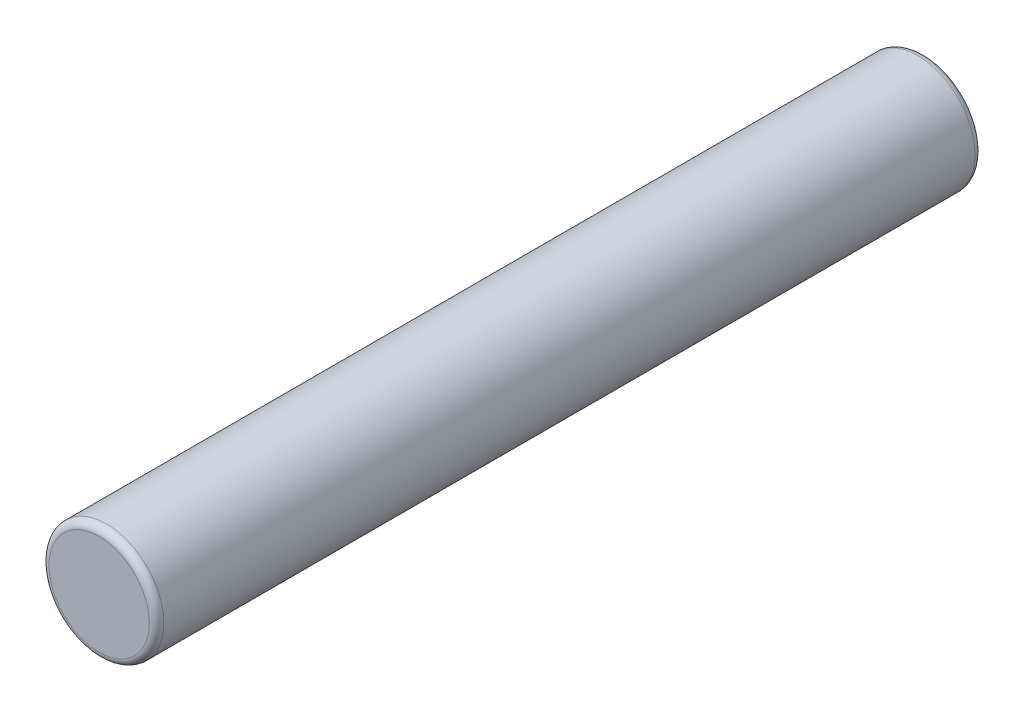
ISO-10303-21;
HEADER;
FILE_DESCRIPTION(('STEP AP214'),'2;1');
FILE_NAME('part.step','',(''),(''),'','','');
FILE_SCHEMA(('AUTOMOTIVE_DESIGN { 1 0 10303 214 1 1 1 1 }'));
ENDSEC;
DATA;
#1=APPLICATION_CONTEXT('core data for automotive mechanical design processes');
#2=APPLICATION_PROTOCOL_DEFINITION('international standard','automotive_design',2000,#1);
#3=PRODUCT_CONTEXT('',#1,'mechanical');
#4=PRODUCT('Part','Part','',(#3));
#5=PRODUCT_RELATED_PRODUCT_CATEGORY('part','',(#4));
#6=PRODUCT_DEFINITION_FORMATION('','',#4);
#7=PRODUCT_DEFINITION_CONTEXT('part definition',#1,'design');
#8=PRODUCT_DEFINITION('design','',#6,#7);
#9=PRODUCT_DEFINITION_SHAPE('','',#8);
#10=(LENGTH_UNIT() NAMED_UNIT(*) SI_UNIT(.MILLI.,.METRE.));
#11=(NAMED_UNIT(*) PLANE_ANGLE_UNIT() SI_UNIT($,.RADIAN.));
#12=(NAMED_UNIT(*) SI_UNIT($,.STERADIAN.) SOLID_ANGLE_UNIT());
#13=UNCERTAINTY_MEASURE_WITH_UNIT(LENGTH_MEASURE(1.E-05),#10,'distance_accuracy_value','');
#14=(GEOMETRIC_REPRESENTATION_CONTEXT(3) GLOBAL_UNCERTAINTY_ASSIGNED_CONTEXT((#13)) GLOBAL_UNIT_ASSIGNED_CONTEXT((#10,
#11,#12)) REPRESENTATION_CONTEXT('',''));
#15=CARTESIAN_POINT('',(0.,0.,0.));
#16=DIRECTION('',(0.,0.,1.));
#17=DIRECTION('',(1.,0.,0.));
#18=AXIS2_PLACEMENT_3D('',#15,#16,#17);
#19=CARTESIAN_POINT('',(0.,0.,114.));
#20=DIRECTION('',(0.,0.,-1.));
#21=DIRECTION('',(-1.,0.,0.));
#22=AXIS2_PLACEMENT_3D('',#19,#20,#21);
#23=CYLINDRICAL_SURFACE('',#22,7.925);
#24=CARTESIAN_POINT('',(0.,0.,1.));
#25=DIRECTION('',(0.,0.,1.));
#26=DIRECTION('',(1.,0.,0.));
#27=AXIS2_PLACEMENT_3D('',#24,#25,#26);
#28=CIRCLE('',#27,7.925);
#29=CARTESIAN_POINT('',(-7.925,0.,1.));
#30=VERTEX_POINT('',#29);
#31=EDGE_CURVE('E41',#30,#30,#28,.T.);
#32=CARTESIAN_POINT('',(0.,0.,113.));
#33=DIRECTION('',(0.,0.,1.));
#34=DIRECTION('',(1.,0.,0.));
#35=AXIS2_PLACEMENT_3D('',#32,#33,#34);
#36=CIRCLE('',#35,7.925);
#37=CARTESIAN_POINT('',(-7.925,0.,113.));
#38=VERTEX_POINT('',#37);
#39=EDGE_CURVE('E45',#38,#38,#36,.F.);
#40=CARTESIAN_POINT('',(-7.925,0.,1.));
#41=CARTESIAN_POINT('',(-7.925,0.,2.16666666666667));
#42=CARTESIAN_POINT('',(-7.925,0.,3.33333333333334));
#43=CARTESIAN_POINT('',(-7.925,0.,5.66666666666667));
#44=CARTESIAN_POINT('',(-7.925,0.,6.83333333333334));
#45=CARTESIAN_POINT('',(-7.925,0.,9.16666666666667));
#46=CARTESIAN_POINT('',(-7.925,0.,10.3333333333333));
#47=CARTESIAN_POINT('',(-7.925,0.,12.6666666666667));
#48=CARTESIAN_POINT('',(-7.925,0.,13.8333333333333));
#49=CARTESIAN_POINT('',(-7.925,0.,16.1666666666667));
#50=CARTESIAN_POINT('',(-7.925,0.,17.3333333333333));
#51=CARTESIAN_POINT('',(-7.925,0.,19.6666666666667));
#52=CARTESIAN_POINT('',(-7.925,0.,20.8333333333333));
#53=CARTESIAN_POINT('',(-7.925,0.,23.1666666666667));
#54=CARTESIAN_POINT('',(-7.925,0.,24.3333333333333));
#55=CARTESIAN_POINT('',(-7.925,0.,26.6666666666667));
#56=CARTESIAN_POINT('',(-7.925,0.,27.8333333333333));
#57=CARTESIAN_POINT('',(-7.925,0.,30.1666666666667));
#58=CARTESIAN_POINT('',(-7.925,0.,31.3333333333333));
#59=CARTESIAN_POINT('',(-7.925,0.,33.6666666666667));
#60=CARTESIAN_POINT('',(-7.925,0.,34.8333333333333));
#61=CARTESIAN_POINT('',(-7.925,0.,37.1666666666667));
#62=CARTESIAN_POINT('',(-7.925,0.,38.3333333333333));
#63=CARTESIAN_POINT('',(-7.925,0.,40.6666666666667));
#64=CARTESIAN_POINT('',(-7.925,0.,41.8333333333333));
#65=CARTESIAN_POINT('',(-7.925,0.,44.1666666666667));
#66=CARTESIAN_POINT('',(-7.925,0.,45.3333333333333));
#67=CARTESIAN_POINT('',(-7.925,0.,47.6666666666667));
#68=CARTESIAN_POINT('',(-7.925,0.,48.8333333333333));
#69=CARTESIAN_POINT('',(-7.925,0.,51.1666666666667));
#70=CARTESIAN_POINT('',(-7.925,0.,52.3333333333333));
#71=CARTESIAN_POINT('',(-7.925,0.,54.6666666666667));
#72=CARTESIAN_POINT('',(-7.925,0.,55.8333333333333));
#73=CARTESIAN_POINT('',(-7.925,0.,58.1666666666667));
#74=CARTESIAN_POINT('',(-7.925,0.,59.3333333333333));
#75=CARTESIAN_POINT('',(-7.925,0.,61.6666666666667));
#76=CARTESIAN_POINT('',(-7.925,0.,62.8333333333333));
#77=CARTESIAN_POINT('',(-7.925,0.,65.1666666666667));
#78=CARTESIAN_POINT('',(-7.925,0.,66.3333333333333));
#79=CARTESIAN_POINT('',(-7.925,0.,68.6666666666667));
#80=CARTESIAN_POINT('',(-7.925,0.,69.8333333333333));
#81=CARTESIAN_POINT('',(-7.925,0.,72.1666666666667));
#82=CARTESIAN_POINT('',(-7.925,0.,73.3333333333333));
#83=CARTESIAN_POINT('',(-7.925,0.,75.6666666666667));
#84=CARTESIAN_POINT('',(-7.925,0.,76.8333333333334));
#85=CARTESIAN_POINT('',(-7.925,0.,79.1666666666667));
#86=CARTESIAN_POINT('',(-7.925,0.,80.3333333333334));
#87=CARTESIAN_POINT('',(-7.925,0.,82.6666666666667));
#88=CARTESIAN_POINT('',(-7.925,0.,83.8333333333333));
#89=CARTESIAN_POINT('',(-7.925,0.,86.1666666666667));
#90=CARTESIAN_POINT('',(-7.925,0.,87.3333333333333));
#91=CARTESIAN_POINT('',(-7.925,0.,89.6666666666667));
#92=CARTESIAN_POINT('',(-7.925,0.,90.8333333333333));
#93=CARTESIAN_POINT('',(-7.925,0.,93.1666666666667));
#94=CARTESIAN_POINT('',(-7.925,0.,94.3333333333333));
#95=CARTESIAN_POINT('',(-7.925,0.,96.6666666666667));
#96=CARTESIAN_POINT('',(-7.925,0.,97.8333333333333));
#97=CARTESIAN_POINT('',(-7.925,0.,100.166666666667));
#98=CARTESIAN_POINT('',(-7.925,0.,101.333333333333));
#99=CARTESIAN_POINT('',(-7.925,0.,103.666666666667));
#100=CARTESIAN_POINT('',(-7.925,0.,104.833333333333));
#101=CARTESIAN_POINT('',(-7.925,0.,107.166666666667));
#102=CARTESIAN_POINT('',(-7.925,0.,108.333333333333));
#103=CARTESIAN_POINT('',(-7.925,0.,110.666666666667));
#104=CARTESIAN_POINT('',(-7.925,0.,111.833333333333));
#105=CARTESIAN_POINT('',(-7.925,0.,113.));
#106=B_SPLINE_CURVE_WITH_KNOTS('',3,(#40,#41,#42,#43,#44,#45,#46,#47,#48,#49,#50,#51,#52,#53,
#54,#55,#56,#57,#58,#59,#60,#61,#62,#63,#64,#65,#66,#67,#68,#69,#70,#71,#72,#73,#74,#75,#76,#77,
#78,#79,#80,#81,#82,#83,#84,#85,#86,#87,#88,#89,#90,#91,#92,#93,#94,#95,#96,#97,#98,#99,#100,
#101,#102,#103,#104,#105),.UNSPECIFIED.,.F.,.F.,(4,2,2,2,2,2,2,2,2,2,2,2,2,2,2,2,2,2,2,2,2,2,2,
2,2,2,2,2,2,2,2,2,4),(0.,3.5,7.00000000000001,10.5,14.,17.5,21.,24.5,28.,31.5,35.,38.5,42.,45.5,
49.,52.5,56.,59.5,63.,66.5,70.,73.5,77.,80.5,84.,87.5,91.,94.5,98.,101.5,105.,108.5,112.),.UNSPECIFIED.);
#107=EDGE_CURVE('BSEAM30',#30,#38,#106,.T.);
#108=ORIENTED_EDGE('',*,*,#31,.T.);
#109=ORIENTED_EDGE('',*,*,#39,.T.);
#110=ORIENTED_EDGE('',*,*,#107,.T.);
#111=ORIENTED_EDGE('',*,*,#107,.F.);
#112=EDGE_LOOP('',(#108,#110,#109,#111));
#113=FACE_BOUND('',#112,.T.);
#114=ADVANCED_FACE('F30',(#113),#23,.T.);
#115=CARTESIAN_POINT('',(0.,0.,114.));
#116=DIRECTION('',(0.,0.,1.));
#117=DIRECTION('',(1.,0.,0.));
#118=AXIS2_PLACEMENT_3D('',#115,#116,#117);
#119=PLANE('',#118);
#120=CARTESIAN_POINT('',(0.,0.,114.));
#121=DIRECTION('',(0.,0.,1.));
#122=DIRECTION('',(1.,0.,0.));
#123=AXIS2_PLACEMENT_3D('',#120,#121,#122);
#124=CIRCLE('',#123,6.925);
#125=CARTESIAN_POINT('',(6.925,0.,114.));
#126=VERTEX_POINT('',#125);
#127=EDGE_CURVE('E10',#126,#126,#124,.T.);
#128=ORIENTED_EDGE('',*,*,#127,.T.);
#129=EDGE_LOOP('',(#128));
#130=FACE_BOUND('',#129,.T.);
#131=ADVANCED_FACE('F61',(#130),#119,.T.);
#132=CARTESIAN_POINT('',(0.,0.,0.));
#133=DIRECTION('',(0.,0.,1.));
#134=DIRECTION('',(1.,0.,0.));
#135=AXIS2_PLACEMENT_3D('',#132,#133,#134);
#136=PLANE('',#135);
#137=CARTESIAN_POINT('',(0.,0.,0.));
#138=DIRECTION('',(0.,0.,1.));
#139=DIRECTION('',(1.,0.,0.));
#140=AXIS2_PLACEMENT_3D('',#137,#138,#139);
#141=CIRCLE('',#140,6.925);
#142=CARTESIAN_POINT('',(6.925,0.,0.));
#143=VERTEX_POINT('',#142);
#144=EDGE_CURVE('E37',#143,#143,#141,.F.);
#145=ORIENTED_EDGE('',*,*,#144,.T.);
#146=EDGE_LOOP('',(#145));
#147=FACE_BOUND('',#146,.T.);
#148=ADVANCED_FACE('F58',(#147),#136,.F.);
#149=CARTESIAN_POINT('',(0.,0.,1.));
#150=DIRECTION('',(0.,0.,1.));
#151=DIRECTION('',(1.,0.,0.));
#152=AXIS2_PLACEMENT_3D('',#149,#150,#151);
#153=TOROIDAL_SURFACE('',#152,6.925,1.);
#154=ORIENTED_EDGE('',*,*,#144,.F.);
#155=EDGE_LOOP('',(#154));
#156=FACE_BOUND('',#155,.T.);
#157=ORIENTED_EDGE('',*,*,#31,.F.);
#158=EDGE_LOOP('',(#157));
#159=FACE_BOUND('',#158,.T.);
#160=ADVANCED_FACE('F54',(#156,#159),#153,.T.);
#161=CARTESIAN_POINT('',(0.,0.,113.));
#162=DIRECTION('',(0.,0.,1.));
#163=DIRECTION('',(1.,0.,0.));
#164=AXIS2_PLACEMENT_3D('',#161,#162,#163);
#165=TOROIDAL_SURFACE('',#164,6.925,1.);
#166=ORIENTED_EDGE('',*,*,#39,.F.);
#167=EDGE_LOOP('',(#166));
#168=FACE_BOUND('',#167,.T.);
#169=ORIENTED_EDGE('',*,*,#127,.F.);
#170=EDGE_LOOP('',(#169));
#171=FACE_BOUND('',#170,.T.);
#172=ADVANCED_FACE('F32',(#168,#171),#165,.T.);
#173=CLOSED_SHELL('',(#114,#131,#148,#160,#172));
#174=MANIFOLD_SOLID_BREP('B2',#173);
#175=ADVANCED_BREP_SHAPE_REPRESENTATION('',(#18,#174),#14);
#176=SHAPE_DEFINITION_REPRESENTATION(#9,#175);
ENDSEC;
END-ISO-10303-21;
